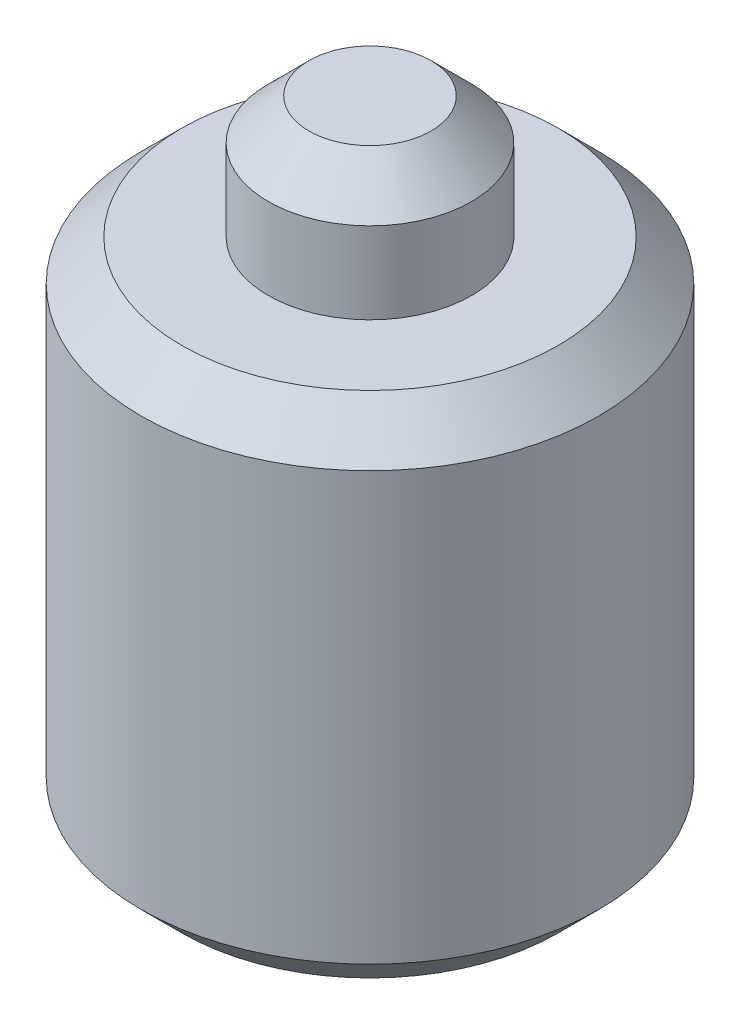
ISO-10303-21;
HEADER;
FILE_DESCRIPTION(('STEP AP214'),'2;1');
FILE_NAME('part.step','',(''),(''),'','','');
FILE_SCHEMA(('AUTOMOTIVE_DESIGN { 1 0 10303 214 1 1 1 1 }'));
ENDSEC;
DATA;
#1=APPLICATION_CONTEXT('core data for automotive mechanical design processes');
#2=APPLICATION_PROTOCOL_DEFINITION('international standard','automotive_design',2000,#1);
#3=PRODUCT_CONTEXT('',#1,'mechanical');
#4=PRODUCT('Part','Part','',(#3));
#5=PRODUCT_RELATED_PRODUCT_CATEGORY('part','',(#4));
#6=PRODUCT_DEFINITION_FORMATION('','',#4);
#7=PRODUCT_DEFINITION_CONTEXT('part definition',#1,'design');
#8=PRODUCT_DEFINITION('design','',#6,#7);
#9=PRODUCT_DEFINITION_SHAPE('','',#8);
#10=(LENGTH_UNIT() NAMED_UNIT(*) SI_UNIT(.MILLI.,.METRE.));
#11=(NAMED_UNIT(*) PLANE_ANGLE_UNIT() SI_UNIT($,.RADIAN.));
#12=(NAMED_UNIT(*) SI_UNIT($,.STERADIAN.) SOLID_ANGLE_UNIT());
#13=UNCERTAINTY_MEASURE_WITH_UNIT(LENGTH_MEASURE(1.E-05),#10,'distance_accuracy_value','');
#14=(GEOMETRIC_REPRESENTATION_CONTEXT(3) GLOBAL_UNCERTAINTY_ASSIGNED_CONTEXT((#13)) GLOBAL_UNIT_ASSIGNED_CONTEXT((#10,
#11,#12)) REPRESENTATION_CONTEXT('',''));
#15=CARTESIAN_POINT('',(0.,0.,0.));
#16=DIRECTION('',(0.,0.,1.));
#17=DIRECTION('',(1.,0.,0.));
#18=AXIS2_PLACEMENT_3D('',#15,#16,#17);
#19=CARTESIAN_POINT('',(0.,0.,0.));
#20=DIRECTION('',(0.,1.,0.));
#21=DIRECTION('',(0.,0.,1.));
#22=AXIS2_PLACEMENT_3D('',#19,#20,#21);
#23=PLANE('',#22);
#24=CARTESIAN_POINT('',(0.,0.,0.));
#25=DIRECTION('',(0.,-1.,0.));
#26=DIRECTION('',(0.,0.,-1.));
#27=AXIS2_PLACEMENT_3D('',#24,#25,#26);
#28=CIRCLE('',#27,2.3495);
#29=CARTESIAN_POINT('',(0.,0.,-2.3495));
#30=VERTEX_POINT('',#29);
#31=EDGE_CURVE('E10',#30,#30,#28,.T.);
#32=ORIENTED_EDGE('',*,*,#31,.T.);
#33=EDGE_LOOP('',(#32));
#34=FACE_BOUND('',#33,.T.);
#35=ADVANCED_FACE('F31',(#34),#23,.F.);
#36=CARTESIAN_POINT('',(0.,0.508,0.));
#37=DIRECTION('',(0.,1.,0.));
#38=DIRECTION('',(0.,0.,1.));
#39=AXIS2_PLACEMENT_3D('',#36,#37,#38);
#40=CONICAL_SURFACE('',#39,2.8575,0.785398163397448);
#41=ORIENTED_EDGE('',*,*,#31,.F.);
#42=EDGE_LOOP('',(#41));
#43=FACE_BOUND('',#42,.T.);
#44=CARTESIAN_POINT('',(0.,0.508,0.));
#45=DIRECTION('',(0.,-1.,0.));
#46=DIRECTION('',(0.,0.,-1.));
#47=AXIS2_PLACEMENT_3D('',#44,#45,#46);
#48=CIRCLE('',#47,2.8575);
#49=CARTESIAN_POINT('',(0.,0.508,-2.8575));
#50=VERTEX_POINT('',#49);
#51=EDGE_CURVE('E37',#50,#50,#48,.T.);
#52=ORIENTED_EDGE('',*,*,#51,.T.);
#53=EDGE_LOOP('',(#52));
#54=FACE_BOUND('',#53,.T.);
#55=ADVANCED_FACE('F72',(#43,#54),#40,.T.);
#56=CARTESIAN_POINT('',(0.,0.,0.));
#57=DIRECTION('',(0.,-1.,0.));
#58=DIRECTION('',(0.,0.,-1.));
#59=AXIS2_PLACEMENT_3D('',#56,#57,#58);
#60=CYLINDRICAL_SURFACE('',#59,2.8575);
#61=ORIENTED_EDGE('',*,*,#51,.F.);
#62=EDGE_LOOP('',(#61));
#63=FACE_BOUND('',#62,.T.);
#64=CARTESIAN_POINT('',(0.,5.842,0.));
#65=DIRECTION('',(0.,-1.,0.));
#66=DIRECTION('',(0.,0.,-1.));
#67=AXIS2_PLACEMENT_3D('',#64,#65,#66);
#68=CIRCLE('',#67,2.8575);
#69=CARTESIAN_POINT('',(0.,5.842,-2.8575));
#70=VERTEX_POINT('',#69);
#71=EDGE_CURVE('E41',#70,#70,#68,.T.);
#72=ORIENTED_EDGE('',*,*,#71,.T.);
#73=EDGE_LOOP('',(#72));
#74=FACE_BOUND('',#73,.T.);
#75=ADVANCED_FACE('F76',(#63,#74),#60,.T.);
#76=CARTESIAN_POINT('',(0.,6.35,0.));
#77=DIRECTION('',(0.,-1.,0.));
#78=DIRECTION('',(0.,0.,-1.));
#79=AXIS2_PLACEMENT_3D('',#76,#77,#78);
#80=CONICAL_SURFACE('',#79,2.3495,0.785398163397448);
#81=ORIENTED_EDGE('',*,*,#71,.F.);
#82=EDGE_LOOP('',(#81));
#83=FACE_BOUND('',#82,.T.);
#84=CARTESIAN_POINT('',(0.,6.35,0.));
#85=DIRECTION('',(0.,-1.,0.));
#86=DIRECTION('',(0.,0.,-1.));
#87=AXIS2_PLACEMENT_3D('',#84,#85,#86);
#88=CIRCLE('',#87,2.3495);
#89=CARTESIAN_POINT('',(0.,6.35,-2.3495));
#90=VERTEX_POINT('',#89);
#91=EDGE_CURVE('E45',#90,#90,#88,.T.);
#92=ORIENTED_EDGE('',*,*,#91,.T.);
#93=EDGE_LOOP('',(#92));
#94=FACE_BOUND('',#93,.T.);
#95=ADVANCED_FACE('F81',(#83,#94),#80,.T.);
#96=CARTESIAN_POINT('',(-2.3495,6.35,0.));
#97=DIRECTION('',(0.,-1.,0.));
#98=DIRECTION('',(0.,0.,-1.));
#99=AXIS2_PLACEMENT_3D('',#96,#97,#98);
#100=PLANE('',#99);
#101=ORIENTED_EDGE('',*,*,#91,.F.);
#102=EDGE_LOOP('',(#101));
#103=FACE_BOUND('',#102,.T.);
#104=CARTESIAN_POINT('',(0.,6.35,0.));
#105=DIRECTION('',(0.,-1.,0.));
#106=DIRECTION('',(0.,0.,-1.));
#107=AXIS2_PLACEMENT_3D('',#104,#105,#106);
#108=CIRCLE('',#107,1.27);
#109=CARTESIAN_POINT('',(0.,6.35,-1.27));
#110=VERTEX_POINT('',#109);
#111=EDGE_CURVE('E50',#110,#110,#108,.T.);
#112=ORIENTED_EDGE('',*,*,#111,.T.);
#113=EDGE_LOOP('',(#112));
#114=FACE_BOUND('',#113,.T.);
#115=ADVANCED_FACE('F87',(#103,#114),#100,.F.);
#116=CARTESIAN_POINT('',(0.,0.,0.));
#117=DIRECTION('',(0.,-1.,0.));
#118=DIRECTION('',(0.,0.,-1.));
#119=AXIS2_PLACEMENT_3D('',#116,#117,#118);
#120=CYLINDRICAL_SURFACE('',#119,1.27);
#121=ORIENTED_EDGE('',*,*,#111,.F.);
#122=EDGE_LOOP('',(#121));
#123=FACE_BOUND('',#122,.T.);
#124=CARTESIAN_POINT('',(0.,7.366,0.));
#125=DIRECTION('',(0.,-1.,0.));
#126=DIRECTION('',(0.,0.,-1.));
#127=AXIS2_PLACEMENT_3D('',#124,#125,#126);
#128=CIRCLE('',#127,1.27);
#129=CARTESIAN_POINT('',(0.,7.366,-1.27));
#130=VERTEX_POINT('',#129);
#131=EDGE_CURVE('E53',#130,#130,#128,.T.);
#132=ORIENTED_EDGE('',*,*,#131,.T.);
#133=EDGE_LOOP('',(#132));
#134=FACE_BOUND('',#133,.T.);
#135=ADVANCED_FACE('F68',(#123,#134),#120,.T.);
#136=CARTESIAN_POINT('',(0.,7.874,0.));
#137=DIRECTION('',(0.,-1.,0.));
#138=DIRECTION('',(0.,0.,-1.));
#139=AXIS2_PLACEMENT_3D('',#136,#137,#138);
#140=CONICAL_SURFACE('',#139,0.762,0.785398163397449);
#141=ORIENTED_EDGE('',*,*,#131,.F.);
#142=EDGE_LOOP('',(#141));
#143=FACE_BOUND('',#142,.T.);
#144=CARTESIAN_POINT('',(0.,7.874,0.));
#145=DIRECTION('',(0.,-1.,0.));
#146=DIRECTION('',(0.,0.,-1.));
#147=AXIS2_PLACEMENT_3D('',#144,#145,#146);
#148=CIRCLE('',#147,0.762);
#149=CARTESIAN_POINT('',(0.,7.874,-0.762));
#150=VERTEX_POINT('',#149);
#151=EDGE_CURVE('E56',#150,#150,#148,.T.);
#152=ORIENTED_EDGE('',*,*,#151,.T.);
#153=EDGE_LOOP('',(#152));
#154=FACE_BOUND('',#153,.T.);
#155=ADVANCED_FACE('F60',(#143,#154),#140,.T.);
#156=CARTESIAN_POINT('',(-0.762,7.874,0.));
#157=DIRECTION('',(0.,-1.,0.));
#158=DIRECTION('',(0.,0.,-1.));
#159=AXIS2_PLACEMENT_3D('',#156,#157,#158);
#160=PLANE('',#159);
#161=ORIENTED_EDGE('',*,*,#151,.F.);
#162=EDGE_LOOP('',(#161));
#163=FACE_BOUND('',#162,.T.);
#164=ADVANCED_FACE('F62',(#163),#160,.F.);
#165=CLOSED_SHELL('',(#35,#55,#75,#95,#115,#135,#155,#164));
#166=MANIFOLD_SOLID_BREP('B2',#165);
#167=ADVANCED_BREP_SHAPE_REPRESENTATION('',(#18,#166),#14);
#168=SHAPE_DEFINITION_REPRESENTATION(#9,#167);
ENDSEC;
END-ISO-10303-21;
